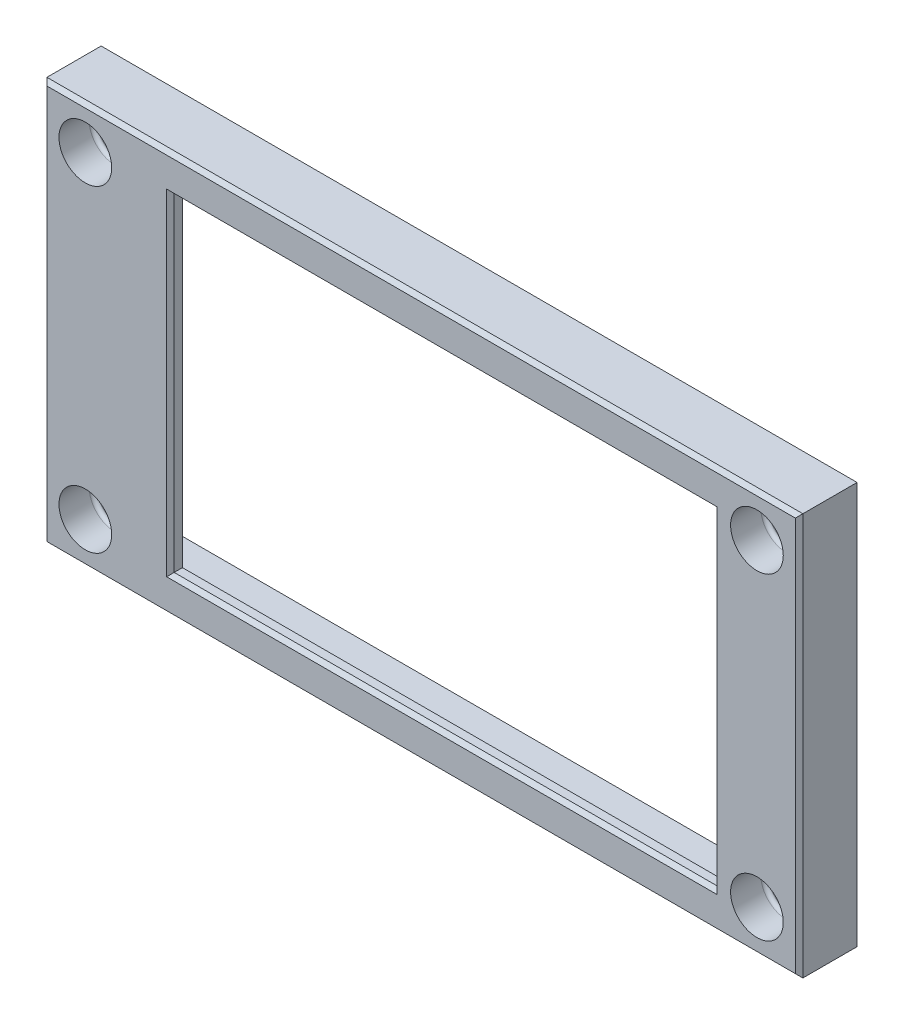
ISO-10303-21;
HEADER;
FILE_DESCRIPTION(('STEP AP214'),'2;1');
FILE_NAME('part.step','',(''),(''),'','','');
FILE_SCHEMA(('AUTOMOTIVE_DESIGN { 1 0 10303 214 1 1 1 1 }'));
ENDSEC;
DATA;
#1=APPLICATION_CONTEXT('core data for automotive mechanical design processes');
#2=APPLICATION_PROTOCOL_DEFINITION('international standard','automotive_design',2000,#1);
#3=PRODUCT_CONTEXT('',#1,'mechanical');
#4=PRODUCT('Part','Part','',(#3));
#5=PRODUCT_RELATED_PRODUCT_CATEGORY('part','',(#4));
#6=PRODUCT_DEFINITION_FORMATION('','',#4);
#7=PRODUCT_DEFINITION_CONTEXT('part definition',#1,'design');
#8=PRODUCT_DEFINITION('design','',#6,#7);
#9=PRODUCT_DEFINITION_SHAPE('','',#8);
#10=(LENGTH_UNIT() NAMED_UNIT(*) SI_UNIT(.MILLI.,.METRE.));
#11=(NAMED_UNIT(*) PLANE_ANGLE_UNIT() SI_UNIT($,.RADIAN.));
#12=(NAMED_UNIT(*) SI_UNIT($,.STERADIAN.) SOLID_ANGLE_UNIT());
#13=UNCERTAINTY_MEASURE_WITH_UNIT(LENGTH_MEASURE(1.E-05),#10,'distance_accuracy_value','');
#14=(GEOMETRIC_REPRESENTATION_CONTEXT(3) GLOBAL_UNCERTAINTY_ASSIGNED_CONTEXT((#13)) GLOBAL_UNIT_ASSIGNED_CONTEXT((#10,
#11,#12)) REPRESENTATION_CONTEXT('',''));
#15=CARTESIAN_POINT('',(0.,0.,0.));
#16=DIRECTION('',(0.,0.,1.));
#17=DIRECTION('',(1.,0.,0.));
#18=AXIS2_PLACEMENT_3D('',#15,#16,#17);
#19=CARTESIAN_POINT('',(0.,0.,7.7));
#20=DIRECTION('',(0.,0.,-1.));
#21=DIRECTION('',(-1.,0.,0.));
#22=AXIS2_PLACEMENT_3D('',#19,#20,#21);
#23=PLANE('',#22);
#24=DIRECTION('',(1.,0.,0.));
#25=VECTOR('',#24,1.);
#26=CARTESIAN_POINT('',(38.8,22.3,7.7));
#27=LINE('',#26,#25);
#28=CARTESIAN_POINT('',(-33.8,22.3,7.7));
#29=VERTEX_POINT('',#28);
#30=CARTESIAN_POINT('',(39.3,22.3,7.7));
#31=VERTEX_POINT('',#30);
#32=EDGE_CURVE('E488',#29,#31,#27,.T.);
#33=ORIENTED_EDGE('',*,*,#32,.T.);
#34=DIRECTION('',(0.,-1.,0.));
#35=VECTOR('',#34,1.);
#36=CARTESIAN_POINT('',(39.3,-21.8,7.7));
#37=LINE('',#36,#35);
#38=CARTESIAN_POINT('',(39.3,-22.3,7.7));
#39=VERTEX_POINT('',#38);
#40=EDGE_CURVE('E490',#31,#39,#37,.T.);
#41=ORIENTED_EDGE('',*,*,#40,.T.);
#42=DIRECTION('',(-1.,0.,0.));
#43=VECTOR('',#42,1.);
#44=CARTESIAN_POINT('',(-33.3,-22.3,7.7));
#45=LINE('',#44,#43);
#46=CARTESIAN_POINT('',(-33.8,-22.3,7.7));
#47=VERTEX_POINT('',#46);
#48=EDGE_CURVE('E486',#39,#47,#45,.T.);
#49=ORIENTED_EDGE('',*,*,#48,.T.);
#50=DIRECTION('',(0.,1.,0.));
#51=VECTOR('',#50,1.);
#52=CARTESIAN_POINT('',(-33.8,21.8,7.7));
#53=LINE('',#52,#51);
#54=EDGE_CURVE('E484',#47,#29,#53,.T.);
#55=ORIENTED_EDGE('',*,*,#54,.T.);
#56=EDGE_LOOP('',(#33,#41,#49,#55));
#57=FACE_BOUND('',#56,.T.);
#58=DIRECTION('',(-1.,0.,0.));
#59=VECTOR('',#58,1.);
#60=CARTESIAN_POINT('',(0.,26.2,7.7));
#61=LINE('',#60,#59);
#62=CARTESIAN_POINT('',(49.7,26.2,7.7));
#63=VERTEX_POINT('',#62);
#64=CARTESIAN_POINT('',(-49.7,26.2,7.7));
#65=VERTEX_POINT('',#64);
#66=EDGE_CURVE('E475',#63,#65,#61,.T.);
#67=ORIENTED_EDGE('',*,*,#66,.T.);
#68=DIRECTION('',(0.,-1.,0.));
#69=VECTOR('',#68,1.);
#70=CARTESIAN_POINT('',(-49.7,0.,7.7));
#71=LINE('',#70,#69);
#72=CARTESIAN_POINT('',(-49.7,-26.2,7.7));
#73=VERTEX_POINT('',#72);
#74=EDGE_CURVE('E481',#65,#73,#71,.T.);
#75=ORIENTED_EDGE('',*,*,#74,.T.);
#76=DIRECTION('',(1.,0.,0.));
#77=VECTOR('',#76,1.);
#78=CARTESIAN_POINT('',(0.,-26.2,7.7));
#79=LINE('',#78,#77);
#80=CARTESIAN_POINT('',(49.7,-26.2,7.7));
#81=VERTEX_POINT('',#80);
#82=EDGE_CURVE('E479',#73,#81,#79,.T.);
#83=ORIENTED_EDGE('',*,*,#82,.T.);
#84=DIRECTION('',(0.,1.,0.));
#85=VECTOR('',#84,1.);
#86=CARTESIAN_POINT('',(49.7,0.,7.7));
#87=LINE('',#86,#85);
#88=EDGE_CURVE('E477',#81,#63,#87,.T.);
#89=ORIENTED_EDGE('',*,*,#88,.T.);
#90=EDGE_LOOP('',(#67,#75,#83,#89));
#91=FACE_BOUND('',#90,.T.);
#92=CARTESIAN_POINT('',(44.6,21.1,7.7));
#93=DIRECTION('',(0.,0.,1.));
#94=DIRECTION('',(1.,0.,0.));
#95=AXIS2_PLACEMENT_3D('',#92,#93,#94);
#96=CIRCLE('',#95,3.5);
#97=CARTESIAN_POINT('',(48.1,21.1,7.7));
#98=VERTEX_POINT('',#97);
#99=EDGE_CURVE('E304',#98,#98,#96,.T.);
#100=ORIENTED_EDGE('',*,*,#99,.F.);
#101=EDGE_LOOP('',(#100));
#102=FACE_BOUND('',#101,.T.);
#103=CARTESIAN_POINT('',(44.6,-21.1,7.7));
#104=DIRECTION('',(0.,0.,-1.));
#105=DIRECTION('',(-1.,0.,0.));
#106=AXIS2_PLACEMENT_3D('',#103,#104,#105);
#107=CIRCLE('',#106,3.5);
#108=CARTESIAN_POINT('',(41.1,-21.1,7.7));
#109=VERTEX_POINT('',#108);
#110=EDGE_CURVE('E301',#109,#109,#107,.T.);
#111=ORIENTED_EDGE('',*,*,#110,.T.);
#112=EDGE_LOOP('',(#111));
#113=FACE_BOUND('',#112,.T.);
#114=CARTESIAN_POINT('',(-44.6,21.1,7.7));
#115=DIRECTION('',(0.,0.,-1.));
#116=DIRECTION('',(-1.,0.,0.));
#117=AXIS2_PLACEMENT_3D('',#114,#115,#116);
#118=CIRCLE('',#117,3.5);
#119=CARTESIAN_POINT('',(-48.1,21.1,7.7));
#120=VERTEX_POINT('',#119);
#121=EDGE_CURVE('E309',#120,#120,#118,.T.);
#122=ORIENTED_EDGE('',*,*,#121,.T.);
#123=EDGE_LOOP('',(#122));
#124=FACE_BOUND('',#123,.T.);
#125=CARTESIAN_POINT('',(-44.6,-21.1,7.7));
#126=DIRECTION('',(0.,0.,1.));
#127=DIRECTION('',(1.,0.,0.));
#128=AXIS2_PLACEMENT_3D('',#125,#126,#127);
#129=CIRCLE('',#128,3.5);
#130=CARTESIAN_POINT('',(-41.1,-21.1,7.7));
#131=VERTEX_POINT('',#130);
#132=EDGE_CURVE('E306',#131,#131,#129,.T.);
#133=ORIENTED_EDGE('',*,*,#132,.F.);
#134=EDGE_LOOP('',(#133));
#135=FACE_BOUND('',#134,.T.);
#136=ADVANCED_FACE('F34',(#57,#91,#102,#113,#124,#135),#23,.F.);
#137=CARTESIAN_POINT('',(44.6,21.1,0.));
#138=DIRECTION('',(0.,0.,1.));
#139=DIRECTION('',(1.,0.,0.));
#140=AXIS2_PLACEMENT_3D('',#137,#138,#139);
#141=CYLINDRICAL_SURFACE('',#140,1.6);
#142=CARTESIAN_POINT('',(44.6,21.1,1.8));
#143=DIRECTION('',(0.,0.,-1.));
#144=DIRECTION('',(-1.,0.,0.));
#145=AXIS2_PLACEMENT_3D('',#142,#143,#144);
#146=CIRCLE('',#145,1.6);
#147=CARTESIAN_POINT('',(43.,21.1,1.8));
#148=VERTEX_POINT('',#147);
#149=EDGE_CURVE('E315',#148,#148,#146,.T.);
#150=ORIENTED_EDGE('',*,*,#149,.T.);
#151=EDGE_LOOP('',(#150));
#152=FACE_BOUND('',#151,.T.);
#153=CARTESIAN_POINT('',(44.6,21.1,3.2));
#154=DIRECTION('',(0.,0.,1.));
#155=DIRECTION('',(1.,0.,0.));
#156=AXIS2_PLACEMENT_3D('',#153,#154,#155);
#157=CIRCLE('',#156,1.6);
#158=CARTESIAN_POINT('',(46.2,21.1,3.2));
#159=VERTEX_POINT('',#158);
#160=EDGE_CURVE('E319',#159,#159,#157,.F.);
#161=ORIENTED_EDGE('',*,*,#160,.F.);
#162=EDGE_LOOP('',(#161));
#163=FACE_BOUND('',#162,.T.);
#164=ADVANCED_FACE('F568',(#152,#163),#141,.F.);
#165=CARTESIAN_POINT('',(-44.6,-21.1,0.));
#166=DIRECTION('',(0.,0.,1.));
#167=DIRECTION('',(1.,0.,0.));
#168=AXIS2_PLACEMENT_3D('',#165,#166,#167);
#169=CYLINDRICAL_SURFACE('',#168,1.6);
#170=CARTESIAN_POINT('',(-44.6,-21.1,1.8));
#171=DIRECTION('',(0.,0.,-1.));
#172=DIRECTION('',(-1.,0.,0.));
#173=AXIS2_PLACEMENT_3D('',#170,#171,#172);
#174=CIRCLE('',#173,1.6);
#175=CARTESIAN_POINT('',(-46.2,-21.1,1.8));
#176=VERTEX_POINT('',#175);
#177=EDGE_CURVE('E318',#176,#176,#174,.T.);
#178=ORIENTED_EDGE('',*,*,#177,.T.);
#179=EDGE_LOOP('',(#178));
#180=FACE_BOUND('',#179,.T.);
#181=CARTESIAN_POINT('',(-44.6,-21.1,3.2));
#182=DIRECTION('',(0.,0.,1.));
#183=DIRECTION('',(1.,0.,0.));
#184=AXIS2_PLACEMENT_3D('',#181,#182,#183);
#185=CIRCLE('',#184,1.6);
#186=CARTESIAN_POINT('',(-43.,-21.1,3.2));
#187=VERTEX_POINT('',#186);
#188=EDGE_CURVE('E434',#187,#187,#185,.F.);
#189=ORIENTED_EDGE('',*,*,#188,.F.);
#190=EDGE_LOOP('',(#189));
#191=FACE_BOUND('',#190,.T.);
#192=ADVANCED_FACE('F610',(#180,#191),#169,.F.);
#193=CARTESIAN_POINT('',(0.,0.,1.8));
#194=DIRECTION('',(0.,0.,-1.));
#195=DIRECTION('',(-1.,0.,0.));
#196=AXIS2_PLACEMENT_3D('',#193,#194,#195);
#197=PLANE('',#196);
#198=DIRECTION('',(0.,1.,0.));
#199=VECTOR('',#198,1.);
#200=CARTESIAN_POINT('',(42.3,15.1,1.8));
#201=LINE('',#200,#199);
#202=CARTESIAN_POINT('',(42.3,-15.1,1.8));
#203=VERTEX_POINT('',#202);
#204=CARTESIAN_POINT('',(42.3,15.1,1.8));
#205=VERTEX_POINT('',#204);
#206=EDGE_CURVE('E51',#203,#205,#201,.T.);
#207=ORIENTED_EDGE('',*,*,#206,.F.);
#208=DIRECTION('',(-1.,0.,0.));
#209=VECTOR('',#208,1.);
#210=CARTESIAN_POINT('',(47.,-15.1,1.8));
#211=LINE('',#210,#209);
#212=CARTESIAN_POINT('',(47.,-15.1,1.8));
#213=VERTEX_POINT('',#212);
#214=EDGE_CURVE('E252',#213,#203,#211,.T.);
#215=ORIENTED_EDGE('',*,*,#214,.F.);
#216=DIRECTION('',(0.,-1.,0.));
#217=VECTOR('',#216,1.);
#218=CARTESIAN_POINT('',(47.,15.1,1.8));
#219=LINE('',#218,#217);
#220=CARTESIAN_POINT('',(47.,15.1,1.8));
#221=VERTEX_POINT('',#220);
#222=EDGE_CURVE('E255',#221,#213,#219,.T.);
#223=ORIENTED_EDGE('',*,*,#222,.F.);
#224=DIRECTION('',(1.,0.,0.));
#225=VECTOR('',#224,1.);
#226=CARTESIAN_POINT('',(47.,15.1,1.8));
#227=LINE('',#226,#225);
#228=EDGE_CURVE('E261',#205,#221,#227,.T.);
#229=ORIENTED_EDGE('',*,*,#228,.F.);
#230=EDGE_LOOP('',(#207,#215,#223,#229));
#231=FACE_BOUND('',#230,.T.);
#232=DIRECTION('',(1.,0.,0.));
#233=VECTOR('',#232,1.);
#234=CARTESIAN_POINT('',(-47.8,-24.3,1.8));
#235=LINE('',#234,#233);
#236=CARTESIAN_POINT('',(41.5,-24.3,1.8));
#237=VERTEX_POINT('',#236);
#238=CARTESIAN_POINT('',(47.8,-24.3,1.8));
#239=VERTEX_POINT('',#238);
#240=EDGE_CURVE('E384',#237,#239,#235,.T.);
#241=ORIENTED_EDGE('',*,*,#240,.F.);
#242=DIRECTION('',(0.,1.,0.));
#243=VECTOR('',#242,1.);
#244=CARTESIAN_POINT('',(41.5,0.,1.8));
#245=LINE('',#244,#243);
#246=CARTESIAN_POINT('',(41.5,24.3,1.8));
#247=VERTEX_POINT('',#246);
#248=EDGE_CURVE('E462',#237,#247,#245,.T.);
#249=ORIENTED_EDGE('',*,*,#248,.T.);
#250=DIRECTION('',(-1.,0.,0.));
#251=VECTOR('',#250,1.);
#252=CARTESIAN_POINT('',(47.8,24.3,1.8));
#253=LINE('',#252,#251);
#254=CARTESIAN_POINT('',(47.8,24.3,1.8));
#255=VERTEX_POINT('',#254);
#256=EDGE_CURVE('E378',#255,#247,#253,.T.);
#257=ORIENTED_EDGE('',*,*,#256,.F.);
#258=DIRECTION('',(0.,1.,0.));
#259=VECTOR('',#258,1.);
#260=CARTESIAN_POINT('',(47.8,-24.3,1.8));
#261=LINE('',#260,#259);
#262=EDGE_CURVE('E373',#239,#255,#261,.T.);
#263=ORIENTED_EDGE('',*,*,#262,.F.);
#264=EDGE_LOOP('',(#241,#249,#257,#263));
#265=FACE_BOUND('',#264,.T.);
#266=ORIENTED_EDGE('',*,*,#149,.F.);
#267=EDGE_LOOP('',(#266));
#268=FACE_BOUND('',#267,.T.);
#269=CARTESIAN_POINT('',(44.6,-21.1,1.8));
#270=DIRECTION('',(0.,0.,-1.));
#271=DIRECTION('',(-1.,0.,0.));
#272=AXIS2_PLACEMENT_3D('',#269,#270,#271);
#273=CIRCLE('',#272,1.6);
#274=CARTESIAN_POINT('',(43.,-21.1,1.8));
#275=VERTEX_POINT('',#274);
#276=EDGE_CURVE('E325',#275,#275,#273,.F.);
#277=ORIENTED_EDGE('',*,*,#276,.T.);
#278=EDGE_LOOP('',(#277));
#279=FACE_BOUND('',#278,.T.);
#280=ADVANCED_FACE('F613',(#231,#265,#268,#279),#197,.T.);
#281=DIRECTION('',(0.,1.,0.));
#282=VECTOR('',#281,1.);
#283=CARTESIAN_POINT('',(-47.,15.1,1.8));
#284=LINE('',#283,#282);
#285=CARTESIAN_POINT('',(-47.,-15.1,1.8));
#286=VERTEX_POINT('',#285);
#287=CARTESIAN_POINT('',(-47.,15.1,1.8));
#288=VERTEX_POINT('',#287);
#289=EDGE_CURVE('E59',#286,#288,#284,.T.);
#290=ORIENTED_EDGE('',*,*,#289,.F.);
#291=DIRECTION('',(-1.,0.,0.));
#292=VECTOR('',#291,1.);
#293=CARTESIAN_POINT('',(-47.,-15.1,1.8));
#294=LINE('',#293,#292);
#295=CARTESIAN_POINT('',(-42.3,-15.1,1.8));
#296=VERTEX_POINT('',#295);
#297=EDGE_CURVE('E276',#296,#286,#294,.T.);
#298=ORIENTED_EDGE('',*,*,#297,.F.);
#299=DIRECTION('',(0.,-1.,0.));
#300=VECTOR('',#299,1.);
#301=CARTESIAN_POINT('',(-42.3,15.1,1.8));
#302=LINE('',#301,#300);
#303=CARTESIAN_POINT('',(-42.3,15.1,1.8));
#304=VERTEX_POINT('',#303);
#305=EDGE_CURVE('E290',#304,#296,#302,.T.);
#306=ORIENTED_EDGE('',*,*,#305,.F.);
#307=DIRECTION('',(1.,0.,0.));
#308=VECTOR('',#307,1.);
#309=CARTESIAN_POINT('',(-47.,15.1,1.8));
#310=LINE('',#309,#308);
#311=EDGE_CURVE('E287',#288,#304,#310,.T.);
#312=ORIENTED_EDGE('',*,*,#311,.F.);
#313=EDGE_LOOP('',(#290,#298,#306,#312));
#314=FACE_BOUND('',#313,.T.);
#315=CARTESIAN_POINT('',(-41.5,24.3,1.8));
#316=VERTEX_POINT('',#315);
#317=CARTESIAN_POINT('',(-47.8,24.3,1.8));
#318=VERTEX_POINT('',#317);
#319=EDGE_CURVE('E376',#316,#318,#253,.T.);
#320=ORIENTED_EDGE('',*,*,#319,.F.);
#321=DIRECTION('',(0.,-1.,0.));
#322=VECTOR('',#321,1.);
#323=CARTESIAN_POINT('',(-41.5,0.,1.8));
#324=LINE('',#323,#322);
#325=CARTESIAN_POINT('',(-41.5,-24.3,1.8));
#326=VERTEX_POINT('',#325);
#327=EDGE_CURVE('E467',#316,#326,#324,.T.);
#328=ORIENTED_EDGE('',*,*,#327,.T.);
#329=CARTESIAN_POINT('',(-47.8,-24.3,1.8));
#330=VERTEX_POINT('',#329);
#331=EDGE_CURVE('E385',#330,#326,#235,.T.);
#332=ORIENTED_EDGE('',*,*,#331,.F.);
#333=DIRECTION('',(0.,-1.,0.));
#334=VECTOR('',#333,1.);
#335=CARTESIAN_POINT('',(-47.8,24.3,1.8));
#336=LINE('',#335,#334);
#337=EDGE_CURVE('E381',#318,#330,#336,.T.);
#338=ORIENTED_EDGE('',*,*,#337,.F.);
#339=EDGE_LOOP('',(#320,#328,#332,#338));
#340=FACE_BOUND('',#339,.T.);
#341=ORIENTED_EDGE('',*,*,#177,.F.);
#342=EDGE_LOOP('',(#341));
#343=FACE_BOUND('',#342,.T.);
#344=CARTESIAN_POINT('',(-44.6,21.1,1.8));
#345=DIRECTION('',(0.,0.,-1.));
#346=DIRECTION('',(-1.,0.,0.));
#347=AXIS2_PLACEMENT_3D('',#344,#345,#346);
#348=CIRCLE('',#347,1.6);
#349=CARTESIAN_POINT('',(-46.2,21.1,1.8));
#350=VERTEX_POINT('',#349);
#351=EDGE_CURVE('E322',#350,#350,#348,.F.);
#352=ORIENTED_EDGE('',*,*,#351,.T.);
#353=EDGE_LOOP('',(#352));
#354=FACE_BOUND('',#353,.T.);
#355=ADVANCED_FACE('F658',(#314,#340,#343,#354),#197,.T.);
#356=CARTESIAN_POINT('',(0.,0.,0.));
#357=DIRECTION('',(0.,0.,1.));
#358=DIRECTION('',(1.,0.,0.));
#359=AXIS2_PLACEMENT_3D('',#356,#357,#358);
#360=PLANE('',#359);
#361=DIRECTION('',(0.,1.,0.));
#362=VECTOR('',#361,1.);
#363=CARTESIAN_POINT('',(50.2,-26.7,0.));
#364=LINE('',#363,#362);
#365=CARTESIAN_POINT('',(50.2,-26.7,0.));
#366=VERTEX_POINT('',#365);
#367=CARTESIAN_POINT('',(50.2,26.7,0.));
#368=VERTEX_POINT('',#367);
#369=EDGE_CURVE('E408',#366,#368,#364,.T.);
#370=ORIENTED_EDGE('',*,*,#369,.F.);
#371=DIRECTION('',(1.,0.,0.));
#372=VECTOR('',#371,1.);
#373=CARTESIAN_POINT('',(-50.2,-26.7,0.));
#374=LINE('',#373,#372);
#375=CARTESIAN_POINT('',(-50.2,-26.7,0.));
#376=VERTEX_POINT('',#375);
#377=EDGE_CURVE('E417',#376,#366,#374,.T.);
#378=ORIENTED_EDGE('',*,*,#377,.F.);
#379=DIRECTION('',(0.,-1.,0.));
#380=VECTOR('',#379,1.);
#381=CARTESIAN_POINT('',(-50.2,26.7,0.));
#382=LINE('',#381,#380);
#383=CARTESIAN_POINT('',(-50.2,26.7,0.));
#384=VERTEX_POINT('',#383);
#385=EDGE_CURVE('E414',#384,#376,#382,.T.);
#386=ORIENTED_EDGE('',*,*,#385,.F.);
#387=DIRECTION('',(-1.,0.,0.));
#388=VECTOR('',#387,1.);
#389=CARTESIAN_POINT('',(50.2,26.7,0.));
#390=LINE('',#389,#388);
#391=EDGE_CURVE('E411',#368,#384,#390,.T.);
#392=ORIENTED_EDGE('',*,*,#391,.F.);
#393=EDGE_LOOP('',(#370,#378,#386,#392));
#394=FACE_BOUND('',#393,.T.);
#395=DIRECTION('',(0.,1.,0.));
#396=VECTOR('',#395,1.);
#397=CARTESIAN_POINT('',(47.8,-24.3,0.));
#398=LINE('',#397,#396);
#399=CARTESIAN_POINT('',(47.8,-24.3,0.));
#400=VERTEX_POINT('',#399);
#401=CARTESIAN_POINT('',(47.8,24.3,0.));
#402=VERTEX_POINT('',#401);
#403=EDGE_CURVE('E372',#400,#402,#398,.T.);
#404=ORIENTED_EDGE('',*,*,#403,.T.);
#405=DIRECTION('',(-1.,0.,0.));
#406=VECTOR('',#405,1.);
#407=CARTESIAN_POINT('',(47.8,24.3,0.));
#408=LINE('',#407,#406);
#409=CARTESIAN_POINT('',(-47.8,24.3,0.));
#410=VERTEX_POINT('',#409);
#411=EDGE_CURVE('E391',#402,#410,#408,.T.);
#412=ORIENTED_EDGE('',*,*,#411,.T.);
#413=DIRECTION('',(0.,-1.,0.));
#414=VECTOR('',#413,1.);
#415=CARTESIAN_POINT('',(-47.8,24.3,0.));
#416=LINE('',#415,#414);
#417=CARTESIAN_POINT('',(-47.8,-24.3,0.));
#418=VERTEX_POINT('',#417);
#419=EDGE_CURVE('E394',#410,#418,#416,.T.);
#420=ORIENTED_EDGE('',*,*,#419,.T.);
#421=DIRECTION('',(1.,0.,0.));
#422=VECTOR('',#421,1.);
#423=CARTESIAN_POINT('',(-47.8,-24.3,0.));
#424=LINE('',#423,#422);
#425=EDGE_CURVE('E377',#418,#400,#424,.T.);
#426=ORIENTED_EDGE('',*,*,#425,.T.);
#427=EDGE_LOOP('',(#404,#412,#420,#426));
#428=FACE_BOUND('',#427,.T.);
#429=ADVANCED_FACE('F552',(#394,#428),#360,.F.);
#430=CARTESIAN_POINT('',(50.2,-26.7,1.8));
#431=DIRECTION('',(-1.,0.,0.));
#432=DIRECTION('',(0.,0.,1.));
#433=AXIS2_PLACEMENT_3D('',#430,#431,#432);
#434=PLANE('',#433);
#435=DIRECTION('',(0.,0.,-1.));
#436=VECTOR('',#435,1.);
#437=CARTESIAN_POINT('',(50.2,26.7,1.8));
#438=LINE('',#437,#436);
#439=CARTESIAN_POINT('',(50.2,26.7,7.2));
#440=VERTEX_POINT('',#439);
#441=EDGE_CURVE('E426',#440,#368,#438,.T.);
#442=ORIENTED_EDGE('',*,*,#441,.F.);
#443=DIRECTION('',(0.,-1.,0.));
#444=VECTOR('',#443,1.);
#445=CARTESIAN_POINT('',(50.2,-26.7,7.2));
#446=LINE('',#445,#444);
#447=CARTESIAN_POINT('',(50.2,-26.7,7.2));
#448=VERTEX_POINT('',#447);
#449=EDGE_CURVE('E504',#440,#448,#446,.T.);
#450=ORIENTED_EDGE('',*,*,#449,.T.);
#451=DIRECTION('',(0.,0.,-1.));
#452=VECTOR('',#451,1.);
#453=CARTESIAN_POINT('',(50.2,-26.7,1.8));
#454=LINE('',#453,#452);
#455=EDGE_CURVE('E420',#448,#366,#454,.T.);
#456=ORIENTED_EDGE('',*,*,#455,.T.);
#457=ORIENTED_EDGE('',*,*,#369,.T.);
#458=EDGE_LOOP('',(#442,#450,#456,#457));
#459=FACE_BOUND('',#458,.T.);
#460=ADVANCED_FACE('F543',(#459),#434,.F.);
#461=CARTESIAN_POINT('',(50.2,26.7,1.8));
#462=DIRECTION('',(0.,-1.,0.));
#463=DIRECTION('',(0.,0.,-1.));
#464=AXIS2_PLACEMENT_3D('',#461,#462,#463);
#465=PLANE('',#464);
#466=DIRECTION('',(0.,0.,-1.));
#467=VECTOR('',#466,1.);
#468=CARTESIAN_POINT('',(-50.2,26.7,1.8));
#469=LINE('',#468,#467);
#470=CARTESIAN_POINT('',(-50.2,26.7,7.2));
#471=VERTEX_POINT('',#470);
#472=EDGE_CURVE('E424',#471,#384,#469,.T.);
#473=ORIENTED_EDGE('',*,*,#472,.F.);
#474=DIRECTION('',(1.,0.,0.));
#475=VECTOR('',#474,1.);
#476=CARTESIAN_POINT('',(50.2,26.7,7.2));
#477=LINE('',#476,#475);
#478=EDGE_CURVE('E506',#471,#440,#477,.T.);
#479=ORIENTED_EDGE('',*,*,#478,.T.);
#480=ORIENTED_EDGE('',*,*,#441,.T.);
#481=ORIENTED_EDGE('',*,*,#391,.T.);
#482=EDGE_LOOP('',(#473,#479,#480,#481));
#483=FACE_BOUND('',#482,.T.);
#484=ADVANCED_FACE('F556',(#483),#465,.F.);
#485=CARTESIAN_POINT('',(-50.2,26.7,1.8));
#486=DIRECTION('',(1.,0.,0.));
#487=DIRECTION('',(0.,0.,-1.));
#488=AXIS2_PLACEMENT_3D('',#485,#486,#487);
#489=PLANE('',#488);
#490=DIRECTION('',(0.,0.,-1.));
#491=VECTOR('',#490,1.);
#492=CARTESIAN_POINT('',(-50.2,-26.7,1.8));
#493=LINE('',#492,#491);
#494=CARTESIAN_POINT('',(-50.2,-26.7,7.2));
#495=VERTEX_POINT('',#494);
#496=EDGE_CURVE('E422',#495,#376,#493,.T.);
#497=ORIENTED_EDGE('',*,*,#496,.F.);
#498=DIRECTION('',(0.,1.,0.));
#499=VECTOR('',#498,1.);
#500=CARTESIAN_POINT('',(-50.2,26.7,7.2));
#501=LINE('',#500,#499);
#502=EDGE_CURVE('E499',#495,#471,#501,.T.);
#503=ORIENTED_EDGE('',*,*,#502,.T.);
#504=ORIENTED_EDGE('',*,*,#472,.T.);
#505=ORIENTED_EDGE('',*,*,#385,.T.);
#506=EDGE_LOOP('',(#497,#503,#504,#505));
#507=FACE_BOUND('',#506,.T.);
#508=ADVANCED_FACE('F558',(#507),#489,.F.);
#509=CARTESIAN_POINT('',(-50.2,-26.7,1.8));
#510=DIRECTION('',(0.,1.,0.));
#511=DIRECTION('',(0.,0.,1.));
#512=AXIS2_PLACEMENT_3D('',#509,#510,#511);
#513=PLANE('',#512);
#514=ORIENTED_EDGE('',*,*,#455,.F.);
#515=DIRECTION('',(-1.,0.,0.));
#516=VECTOR('',#515,1.);
#517=CARTESIAN_POINT('',(-50.2,-26.7,7.2));
#518=LINE('',#517,#516);
#519=EDGE_CURVE('E502',#448,#495,#518,.T.);
#520=ORIENTED_EDGE('',*,*,#519,.T.);
#521=ORIENTED_EDGE('',*,*,#496,.T.);
#522=ORIENTED_EDGE('',*,*,#377,.T.);
#523=EDGE_LOOP('',(#514,#520,#521,#522));
#524=FACE_BOUND('',#523,.T.);
#525=ADVANCED_FACE('F545',(#524),#513,.F.);
#526=CARTESIAN_POINT('',(47.8,-24.3,1.8));
#527=DIRECTION('',(-1.,0.,0.));
#528=DIRECTION('',(0.,-1.,0.));
#529=AXIS2_PLACEMENT_3D('',#526,#527,#528);
#530=PLANE('',#529);
#531=ORIENTED_EDGE('',*,*,#403,.F.);
#532=DIRECTION('',(0.,0.,-1.));
#533=VECTOR('',#532,1.);
#534=CARTESIAN_POINT('',(47.8,-24.3,1.8));
#535=LINE('',#534,#533);
#536=EDGE_CURVE('E388',#239,#400,#535,.T.);
#537=ORIENTED_EDGE('',*,*,#536,.F.);
#538=ORIENTED_EDGE('',*,*,#262,.T.);
#539=DIRECTION('',(0.,0.,-1.));
#540=VECTOR('',#539,1.);
#541=CARTESIAN_POINT('',(47.8,24.3,1.8));
#542=LINE('',#541,#540);
#543=EDGE_CURVE('E405',#255,#402,#542,.T.);
#544=ORIENTED_EDGE('',*,*,#543,.T.);
#545=EDGE_LOOP('',(#531,#537,#538,#544));
#546=FACE_BOUND('',#545,.T.);
#547=ADVANCED_FACE('F670',(#546),#530,.T.);
#548=CARTESIAN_POINT('',(47.8,24.3,1.8));
#549=DIRECTION('',(0.,-1.,0.));
#550=DIRECTION('',(0.,0.,-1.));
#551=AXIS2_PLACEMENT_3D('',#548,#549,#550);
#552=PLANE('',#551);
#553=ORIENTED_EDGE('',*,*,#411,.F.);
#554=ORIENTED_EDGE('',*,*,#543,.F.);
#555=ORIENTED_EDGE('',*,*,#256,.T.);
#556=DIRECTION('',(0.707106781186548,0.,-0.707106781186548));
#557=VECTOR('',#556,1.);
#558=CARTESIAN_POINT('',(41.5,24.3,1.8));
#559=LINE('',#558,#557);
#560=CARTESIAN_POINT('',(41.,24.3,2.3));
#561=VERTEX_POINT('',#560);
#562=EDGE_CURVE('E508',#247,#561,#559,.F.);
#563=ORIENTED_EDGE('',*,*,#562,.T.);
#564=DIRECTION('',(0.,0.,-1.));
#565=VECTOR('',#564,1.);
#566=CARTESIAN_POINT('',(41.,24.3,6.1));
#567=LINE('',#566,#565);
#568=CARTESIAN_POINT('',(41.,24.3,6.1));
#569=VERTEX_POINT('',#568);
#570=EDGE_CURVE('E369',#569,#561,#567,.T.);
#571=ORIENTED_EDGE('',*,*,#570,.F.);
#572=DIRECTION('',(-1.,0.,0.));
#573=VECTOR('',#572,1.);
#574=CARTESIAN_POINT('',(-41.,24.3,6.1));
#575=LINE('',#574,#573);
#576=CARTESIAN_POINT('',(-41.,24.3,6.1));
#577=VERTEX_POINT('',#576);
#578=EDGE_CURVE('E351',#569,#577,#575,.T.);
#579=ORIENTED_EDGE('',*,*,#578,.T.);
#580=DIRECTION('',(0.,0.,-1.));
#581=VECTOR('',#580,1.);
#582=CARTESIAN_POINT('',(-41.,24.3,6.1));
#583=LINE('',#582,#581);
#584=CARTESIAN_POINT('',(-41.,24.3,2.3));
#585=VERTEX_POINT('',#584);
#586=EDGE_CURVE('E366',#577,#585,#583,.T.);
#587=ORIENTED_EDGE('',*,*,#586,.T.);
#588=DIRECTION('',(0.707106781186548,0.,0.707106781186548));
#589=VECTOR('',#588,1.);
#590=CARTESIAN_POINT('',(-41.5,24.3,1.8));
#591=LINE('',#590,#589);
#592=EDGE_CURVE('E11',#585,#316,#591,.F.);
#593=ORIENTED_EDGE('',*,*,#592,.T.);
#594=ORIENTED_EDGE('',*,*,#319,.T.);
#595=DIRECTION('',(0.,0.,-1.));
#596=VECTOR('',#595,1.);
#597=CARTESIAN_POINT('',(-47.8,24.3,1.8));
#598=LINE('',#597,#596);
#599=EDGE_CURVE('E403',#318,#410,#598,.T.);
#600=ORIENTED_EDGE('',*,*,#599,.T.);
#601=EDGE_LOOP('',(#553,#554,#555,#563,#571,#579,#587,#593,#594,#600));
#602=FACE_BOUND('',#601,.T.);
#603=ADVANCED_FACE('F666',(#602),#552,.T.);
#604=CARTESIAN_POINT('',(-47.8,24.3,1.8));
#605=DIRECTION('',(1.,0.,0.));
#606=DIRECTION('',(0.,0.,-1.));
#607=AXIS2_PLACEMENT_3D('',#604,#605,#606);
#608=PLANE('',#607);
#609=ORIENTED_EDGE('',*,*,#419,.F.);
#610=ORIENTED_EDGE('',*,*,#599,.F.);
#611=ORIENTED_EDGE('',*,*,#337,.T.);
#612=DIRECTION('',(0.,0.,-1.));
#613=VECTOR('',#612,1.);
#614=CARTESIAN_POINT('',(-47.8,-24.3,1.8));
#615=LINE('',#614,#613);
#616=EDGE_CURVE('E401',#330,#418,#615,.T.);
#617=ORIENTED_EDGE('',*,*,#616,.T.);
#618=EDGE_LOOP('',(#609,#610,#611,#617));
#619=FACE_BOUND('',#618,.T.);
#620=ADVANCED_FACE('F662',(#619),#608,.T.);
#621=CARTESIAN_POINT('',(-47.8,-24.3,1.8));
#622=DIRECTION('',(0.,1.,0.));
#623=DIRECTION('',(-1.,0.,0.));
#624=AXIS2_PLACEMENT_3D('',#621,#622,#623);
#625=PLANE('',#624);
#626=ORIENTED_EDGE('',*,*,#425,.F.);
#627=ORIENTED_EDGE('',*,*,#616,.F.);
#628=ORIENTED_EDGE('',*,*,#331,.T.);
#629=DIRECTION('',(-0.707106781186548,0.,-0.707106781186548));
#630=VECTOR('',#629,1.);
#631=CARTESIAN_POINT('',(-41.5,-24.3,1.8));
#632=LINE('',#631,#630);
#633=CARTESIAN_POINT('',(-41.,-24.3,2.3));
#634=VERTEX_POINT('',#633);
#635=EDGE_CURVE('E43',#326,#634,#632,.F.);
#636=ORIENTED_EDGE('',*,*,#635,.T.);
#637=DIRECTION('',(0.,0.,-1.));
#638=VECTOR('',#637,1.);
#639=CARTESIAN_POINT('',(-41.,-24.3,6.1));
#640=LINE('',#639,#638);
#641=CARTESIAN_POINT('',(-41.,-24.3,6.1));
#642=VERTEX_POINT('',#641);
#643=EDGE_CURVE('E363',#642,#634,#640,.T.);
#644=ORIENTED_EDGE('',*,*,#643,.F.);
#645=DIRECTION('',(1.,0.,0.));
#646=VECTOR('',#645,1.);
#647=CARTESIAN_POINT('',(-41.,-24.3,6.1));
#648=LINE('',#647,#646);
#649=CARTESIAN_POINT('',(41.,-24.3,6.1));
#650=VERTEX_POINT('',#649);
#651=EDGE_CURVE('E357',#642,#650,#648,.T.);
#652=ORIENTED_EDGE('',*,*,#651,.T.);
#653=DIRECTION('',(0.,0.,-1.));
#654=VECTOR('',#653,1.);
#655=CARTESIAN_POINT('',(41.,-24.3,6.1));
#656=LINE('',#655,#654);
#657=CARTESIAN_POINT('',(41.,-24.3,2.3));
#658=VERTEX_POINT('',#657);
#659=EDGE_CURVE('E360',#650,#658,#656,.T.);
#660=ORIENTED_EDGE('',*,*,#659,.T.);
#661=DIRECTION('',(-0.707106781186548,0.,0.707106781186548));
#662=VECTOR('',#661,1.);
#663=CARTESIAN_POINT('',(41.5,-24.3,1.8));
#664=LINE('',#663,#662);
#665=EDGE_CURVE('E510',#658,#237,#664,.F.);
#666=ORIENTED_EDGE('',*,*,#665,.T.);
#667=ORIENTED_EDGE('',*,*,#240,.T.);
#668=ORIENTED_EDGE('',*,*,#536,.T.);
#669=EDGE_LOOP('',(#626,#627,#628,#636,#644,#652,#660,#666,#667,#668));
#670=FACE_BOUND('',#669,.T.);
#671=ADVANCED_FACE('F654',(#670),#625,.T.);
#672=CARTESIAN_POINT('',(41.,-24.3,6.1));
#673=DIRECTION('',(-1.,0.,0.));
#674=DIRECTION('',(0.,0.,1.));
#675=AXIS2_PLACEMENT_3D('',#672,#673,#674);
#676=PLANE('',#675);
#677=ORIENTED_EDGE('',*,*,#570,.T.);
#678=DIRECTION('',(0.,-1.,0.));
#679=VECTOR('',#678,1.);
#680=CARTESIAN_POINT('',(41.,-24.3,2.3));
#681=LINE('',#680,#679);
#682=EDGE_CURVE('E465',#561,#658,#681,.T.);
#683=ORIENTED_EDGE('',*,*,#682,.T.);
#684=ORIENTED_EDGE('',*,*,#659,.F.);
#685=DIRECTION('',(0.,1.,0.));
#686=VECTOR('',#685,1.);
#687=CARTESIAN_POINT('',(41.,-24.3,6.1));
#688=LINE('',#687,#686);
#689=EDGE_CURVE('E348',#650,#569,#688,.T.);
#690=ORIENTED_EDGE('',*,*,#689,.T.);
#691=EDGE_LOOP('',(#677,#683,#684,#690));
#692=FACE_BOUND('',#691,.T.);
#693=ADVANCED_FACE('F650',(#692),#676,.T.);
#694=CARTESIAN_POINT('',(-41.,-24.3,6.1));
#695=DIRECTION('',(1.,0.,0.));
#696=DIRECTION('',(0.,0.,-1.));
#697=AXIS2_PLACEMENT_3D('',#694,#695,#696);
#698=PLANE('',#697);
#699=ORIENTED_EDGE('',*,*,#643,.T.);
#700=DIRECTION('',(0.,1.,0.));
#701=VECTOR('',#700,1.);
#702=CARTESIAN_POINT('',(-41.,-24.3,2.3));
#703=LINE('',#702,#701);
#704=EDGE_CURVE('E470',#634,#585,#703,.T.);
#705=ORIENTED_EDGE('',*,*,#704,.T.);
#706=ORIENTED_EDGE('',*,*,#586,.F.);
#707=DIRECTION('',(0.,-1.,0.));
#708=VECTOR('',#707,1.);
#709=CARTESIAN_POINT('',(-41.,-24.3,6.1));
#710=LINE('',#709,#708);
#711=EDGE_CURVE('E354',#577,#642,#710,.T.);
#712=ORIENTED_EDGE('',*,*,#711,.T.);
#713=EDGE_LOOP('',(#699,#705,#706,#712));
#714=FACE_BOUND('',#713,.T.);
#715=ADVANCED_FACE('F646',(#714),#698,.T.);
#716=CARTESIAN_POINT('',(0.,0.,6.1));
#717=DIRECTION('',(0.,0.,-1.));
#718=DIRECTION('',(-1.,0.,0.));
#719=AXIS2_PLACEMENT_3D('',#716,#717,#718);
#720=PLANE('',#719);
#721=DIRECTION('',(-1.,0.,0.));
#722=VECTOR('',#721,1.);
#723=CARTESIAN_POINT('',(-33.3,21.8,6.1));
#724=LINE('',#723,#722);
#725=CARTESIAN_POINT('',(38.8,21.8,6.1));
#726=VERTEX_POINT('',#725);
#727=CARTESIAN_POINT('',(-33.3,21.8,6.1));
#728=VERTEX_POINT('',#727);
#729=EDGE_CURVE('E337',#726,#728,#724,.T.);
#730=ORIENTED_EDGE('',*,*,#729,.T.);
#731=DIRECTION('',(0.,-1.,0.));
#732=VECTOR('',#731,1.);
#733=CARTESIAN_POINT('',(-33.3,21.8,6.1));
#734=LINE('',#733,#732);
#735=CARTESIAN_POINT('',(-33.3,-21.8,6.1));
#736=VERTEX_POINT('',#735);
#737=EDGE_CURVE('E328',#728,#736,#734,.T.);
#738=ORIENTED_EDGE('',*,*,#737,.T.);
#739=DIRECTION('',(1.,0.,0.));
#740=VECTOR('',#739,1.);
#741=CARTESIAN_POINT('',(-33.3,-21.8,6.1));
#742=LINE('',#741,#740);
#743=CARTESIAN_POINT('',(38.8,-21.8,6.1));
#744=VERTEX_POINT('',#743);
#745=EDGE_CURVE('E331',#736,#744,#742,.T.);
#746=ORIENTED_EDGE('',*,*,#745,.T.);
#747=DIRECTION('',(0.,1.,0.));
#748=VECTOR('',#747,1.);
#749=CARTESIAN_POINT('',(38.8,21.8,6.1));
#750=LINE('',#749,#748);
#751=EDGE_CURVE('E334',#744,#726,#750,.T.);
#752=ORIENTED_EDGE('',*,*,#751,.T.);
#753=EDGE_LOOP('',(#730,#738,#746,#752));
#754=FACE_BOUND('',#753,.T.);
#755=ORIENTED_EDGE('',*,*,#689,.F.);
#756=ORIENTED_EDGE('',*,*,#651,.F.);
#757=ORIENTED_EDGE('',*,*,#711,.F.);
#758=ORIENTED_EDGE('',*,*,#578,.F.);
#759=EDGE_LOOP('',(#755,#756,#757,#758));
#760=FACE_BOUND('',#759,.T.);
#761=ADVANCED_FACE('F641',(#754,#760),#720,.T.);
#762=CARTESIAN_POINT('',(-33.3,21.8,7.7));
#763=DIRECTION('',(1.,0.,0.));
#764=DIRECTION('',(0.,0.,-1.));
#765=AXIS2_PLACEMENT_3D('',#762,#763,#764);
#766=PLANE('',#765);
#767=DIRECTION('',(0.,0.,-1.));
#768=VECTOR('',#767,1.);
#769=CARTESIAN_POINT('',(-33.3,21.8,7.7));
#770=LINE('',#769,#768);
#771=CARTESIAN_POINT('',(-33.3,21.8,7.2));
#772=VERTEX_POINT('',#771);
#773=EDGE_CURVE('E340',#772,#728,#770,.T.);
#774=ORIENTED_EDGE('',*,*,#773,.F.);
#775=DIRECTION('',(0.,-1.,0.));
#776=VECTOR('',#775,1.);
#777=CARTESIAN_POINT('',(-33.3,-21.8,7.2));
#778=LINE('',#777,#776);
#779=CARTESIAN_POINT('',(-33.3,-21.8,7.2));
#780=VERTEX_POINT('',#779);
#781=EDGE_CURVE('E497',#772,#780,#778,.T.);
#782=ORIENTED_EDGE('',*,*,#781,.T.);
#783=DIRECTION('',(0.,0.,-1.));
#784=VECTOR('',#783,1.);
#785=CARTESIAN_POINT('',(-33.3,-21.8,7.7));
#786=LINE('',#785,#784);
#787=EDGE_CURVE('E346',#780,#736,#786,.T.);
#788=ORIENTED_EDGE('',*,*,#787,.T.);
#789=ORIENTED_EDGE('',*,*,#737,.F.);
#790=EDGE_LOOP('',(#774,#782,#788,#789));
#791=FACE_BOUND('',#790,.T.);
#792=ADVANCED_FACE('F638',(#791),#766,.T.);
#793=CARTESIAN_POINT('',(-33.3,-21.8,7.7));
#794=DIRECTION('',(0.,1.,0.));
#795=DIRECTION('',(0.,0.,1.));
#796=AXIS2_PLACEMENT_3D('',#793,#794,#795);
#797=PLANE('',#796);
#798=ORIENTED_EDGE('',*,*,#787,.F.);
#799=DIRECTION('',(1.,0.,0.));
#800=VECTOR('',#799,1.);
#801=CARTESIAN_POINT('',(38.8,-21.8,7.2));
#802=LINE('',#801,#800);
#803=CARTESIAN_POINT('',(38.8,-21.8,7.2));
#804=VERTEX_POINT('',#803);
#805=EDGE_CURVE('E495',#780,#804,#802,.T.);
#806=ORIENTED_EDGE('',*,*,#805,.T.);
#807=DIRECTION('',(0.,0.,-1.));
#808=VECTOR('',#807,1.);
#809=CARTESIAN_POINT('',(38.8,-21.8,7.7));
#810=LINE('',#809,#808);
#811=EDGE_CURVE('E344',#804,#744,#810,.T.);
#812=ORIENTED_EDGE('',*,*,#811,.T.);
#813=ORIENTED_EDGE('',*,*,#745,.F.);
#814=EDGE_LOOP('',(#798,#806,#812,#813));
#815=FACE_BOUND('',#814,.T.);
#816=ADVANCED_FACE('F634',(#815),#797,.T.);
#817=CARTESIAN_POINT('',(38.8,21.8,7.7));
#818=DIRECTION('',(-1.,0.,0.));
#819=DIRECTION('',(0.,0.,1.));
#820=AXIS2_PLACEMENT_3D('',#817,#818,#819);
#821=PLANE('',#820);
#822=ORIENTED_EDGE('',*,*,#811,.F.);
#823=DIRECTION('',(0.,1.,0.));
#824=VECTOR('',#823,1.);
#825=CARTESIAN_POINT('',(38.8,21.8,7.2));
#826=LINE('',#825,#824);
#827=CARTESIAN_POINT('',(38.8,21.8,7.2));
#828=VERTEX_POINT('',#827);
#829=EDGE_CURVE('E472',#804,#828,#826,.T.);
#830=ORIENTED_EDGE('',*,*,#829,.T.);
#831=DIRECTION('',(0.,0.,-1.));
#832=VECTOR('',#831,1.);
#833=CARTESIAN_POINT('',(38.8,21.8,7.7));
#834=LINE('',#833,#832);
#835=EDGE_CURVE('E342',#828,#726,#834,.T.);
#836=ORIENTED_EDGE('',*,*,#835,.T.);
#837=ORIENTED_EDGE('',*,*,#751,.F.);
#838=EDGE_LOOP('',(#822,#830,#836,#837));
#839=FACE_BOUND('',#838,.T.);
#840=ADVANCED_FACE('F630',(#839),#821,.T.);
#841=CARTESIAN_POINT('',(-33.3,21.8,7.7));
#842=DIRECTION('',(0.,-1.,0.));
#843=DIRECTION('',(0.,0.,-1.));
#844=AXIS2_PLACEMENT_3D('',#841,#842,#843);
#845=PLANE('',#844);
#846=ORIENTED_EDGE('',*,*,#835,.F.);
#847=DIRECTION('',(-1.,0.,0.));
#848=VECTOR('',#847,1.);
#849=CARTESIAN_POINT('',(-33.3,21.8,7.2));
#850=LINE('',#849,#848);
#851=EDGE_CURVE('E493',#828,#772,#850,.T.);
#852=ORIENTED_EDGE('',*,*,#851,.T.);
#853=ORIENTED_EDGE('',*,*,#773,.T.);
#854=ORIENTED_EDGE('',*,*,#729,.F.);
#855=EDGE_LOOP('',(#846,#852,#853,#854));
#856=FACE_BOUND('',#855,.T.);
#857=ADVANCED_FACE('F619',(#856),#845,.T.);
#858=CARTESIAN_POINT('',(-44.6,21.1,0.));
#859=DIRECTION('',(0.,0.,1.));
#860=DIRECTION('',(1.,0.,0.));
#861=AXIS2_PLACEMENT_3D('',#858,#859,#860);
#862=CYLINDRICAL_SURFACE('',#861,1.6);
#863=CARTESIAN_POINT('',(-44.6,21.1,3.2));
#864=DIRECTION('',(0.,0.,-1.));
#865=DIRECTION('',(-1.,0.,0.));
#866=AXIS2_PLACEMENT_3D('',#863,#864,#865);
#867=CIRCLE('',#866,1.6);
#868=CARTESIAN_POINT('',(-46.2,21.1,3.2));
#869=VERTEX_POINT('',#868);
#870=EDGE_CURVE('E431',#869,#869,#867,.T.);
#871=ORIENTED_EDGE('',*,*,#870,.F.);
#872=EDGE_LOOP('',(#871));
#873=FACE_BOUND('',#872,.T.);
#874=ORIENTED_EDGE('',*,*,#351,.F.);
#875=EDGE_LOOP('',(#874));
#876=FACE_BOUND('',#875,.T.);
#877=ADVANCED_FACE('F615',(#873,#876),#862,.F.);
#878=CARTESIAN_POINT('',(44.6,-21.1,0.));
#879=DIRECTION('',(0.,0.,1.));
#880=DIRECTION('',(1.,0.,0.));
#881=AXIS2_PLACEMENT_3D('',#878,#879,#880);
#882=CYLINDRICAL_SURFACE('',#881,1.6);
#883=CARTESIAN_POINT('',(44.6,-21.1,3.2));
#884=DIRECTION('',(0.,0.,-1.));
#885=DIRECTION('',(-1.,0.,0.));
#886=AXIS2_PLACEMENT_3D('',#883,#884,#885);
#887=CIRCLE('',#886,1.6);
#888=CARTESIAN_POINT('',(43.,-21.1,3.2));
#889=VERTEX_POINT('',#888);
#890=EDGE_CURVE('E314',#889,#889,#887,.T.);
#891=ORIENTED_EDGE('',*,*,#890,.F.);
#892=EDGE_LOOP('',(#891));
#893=FACE_BOUND('',#892,.T.);
#894=ORIENTED_EDGE('',*,*,#276,.F.);
#895=EDGE_LOOP('',(#894));
#896=FACE_BOUND('',#895,.T.);
#897=ADVANCED_FACE('F618',(#893,#896),#882,.F.);
#898=CARTESIAN_POINT('',(44.6,-21.1,3.2));
#899=DIRECTION('',(0.,0.,1.));
#900=DIRECTION('',(1.,0.,0.));
#901=AXIS2_PLACEMENT_3D('',#898,#899,#900);
#902=CYLINDRICAL_SURFACE('',#901,3.5);
#903=CARTESIAN_POINT('',(44.6,-21.1,3.7));
#904=DIRECTION('',(0.,0.,-1.));
#905=DIRECTION('',(-1.,0.,0.));
#906=AXIS2_PLACEMENT_3D('',#903,#904,#905);
#907=CIRCLE('',#906,3.5);
#908=CARTESIAN_POINT('',(41.1,-21.1,3.7));
#909=VERTEX_POINT('',#908);
#910=EDGE_CURVE('E444',#909,#909,#907,.T.);
#911=ORIENTED_EDGE('',*,*,#910,.T.);
#912=EDGE_LOOP('',(#911));
#913=FACE_BOUND('',#912,.T.);
#914=ORIENTED_EDGE('',*,*,#110,.F.);
#915=EDGE_LOOP('',(#914));
#916=FACE_BOUND('',#915,.T.);
#917=ADVANCED_FACE('F623',(#913,#916),#902,.F.);
#918=CARTESIAN_POINT('',(44.6,-21.1,3.2));
#919=DIRECTION('',(0.,0.,-1.));
#920=DIRECTION('',(-1.,0.,0.));
#921=AXIS2_PLACEMENT_3D('',#918,#919,#920);
#922=PLANE('',#921);
#923=CARTESIAN_POINT('',(44.6,-21.1,3.2));
#924=DIRECTION('',(0.,0.,-1.));
#925=DIRECTION('',(-1.,0.,0.));
#926=AXIS2_PLACEMENT_3D('',#923,#924,#925);
#927=CIRCLE('',#926,3.);
#928=CARTESIAN_POINT('',(41.6,-21.1,3.2));
#929=VERTEX_POINT('',#928);
#930=EDGE_CURVE('E447',#929,#929,#927,.F.);
#931=ORIENTED_EDGE('',*,*,#930,.T.);
#932=EDGE_LOOP('',(#931));
#933=FACE_BOUND('',#932,.T.);
#934=ORIENTED_EDGE('',*,*,#890,.T.);
#935=EDGE_LOOP('',(#934));
#936=FACE_BOUND('',#935,.T.);
#937=ADVANCED_FACE('F596',(#933,#936),#922,.F.);
#938=CARTESIAN_POINT('',(-44.6,21.1,3.2));
#939=DIRECTION('',(0.,0.,1.));
#940=DIRECTION('',(1.,0.,0.));
#941=AXIS2_PLACEMENT_3D('',#938,#939,#940);
#942=CYLINDRICAL_SURFACE('',#941,3.5);
#943=CARTESIAN_POINT('',(-44.6,21.1,3.7));
#944=DIRECTION('',(0.,0.,-1.));
#945=DIRECTION('',(-1.,0.,0.));
#946=AXIS2_PLACEMENT_3D('',#943,#944,#945);
#947=CIRCLE('',#946,3.5);
#948=CARTESIAN_POINT('',(-48.1,21.1,3.7));
#949=VERTEX_POINT('',#948);
#950=EDGE_CURVE('E456',#949,#949,#947,.T.);
#951=ORIENTED_EDGE('',*,*,#950,.T.);
#952=EDGE_LOOP('',(#951));
#953=FACE_BOUND('',#952,.T.);
#954=ORIENTED_EDGE('',*,*,#121,.F.);
#955=EDGE_LOOP('',(#954));
#956=FACE_BOUND('',#955,.T.);
#957=ADVANCED_FACE('F605',(#953,#956),#942,.F.);
#958=CARTESIAN_POINT('',(-44.6,21.1,3.2));
#959=DIRECTION('',(0.,0.,-1.));
#960=DIRECTION('',(-1.,0.,0.));
#961=AXIS2_PLACEMENT_3D('',#958,#959,#960);
#962=PLANE('',#961);
#963=CARTESIAN_POINT('',(-44.6,21.1,3.2));
#964=DIRECTION('',(0.,0.,-1.));
#965=DIRECTION('',(-1.,0.,0.));
#966=AXIS2_PLACEMENT_3D('',#963,#964,#965);
#967=CIRCLE('',#966,3.);
#968=CARTESIAN_POINT('',(-47.6,21.1,3.2));
#969=VERTEX_POINT('',#968);
#970=EDGE_CURVE('E459',#969,#969,#967,.F.);
#971=ORIENTED_EDGE('',*,*,#970,.T.);
#972=EDGE_LOOP('',(#971));
#973=FACE_BOUND('',#972,.T.);
#974=ORIENTED_EDGE('',*,*,#870,.T.);
#975=EDGE_LOOP('',(#974));
#976=FACE_BOUND('',#975,.T.);
#977=ADVANCED_FACE('F592',(#973,#976),#962,.F.);
#978=CARTESIAN_POINT('',(-44.6,-21.1,3.2));
#979=DIRECTION('',(0.,0.,1.));
#980=DIRECTION('',(1.,0.,0.));
#981=AXIS2_PLACEMENT_3D('',#978,#979,#980);
#982=PLANE('',#981);
#983=CARTESIAN_POINT('',(-44.6,-21.1,3.2));
#984=DIRECTION('',(0.,0.,1.));
#985=DIRECTION('',(1.,0.,0.));
#986=AXIS2_PLACEMENT_3D('',#983,#984,#985);
#987=CIRCLE('',#986,3.);
#988=CARTESIAN_POINT('',(-41.6,-21.1,3.2));
#989=VERTEX_POINT('',#988);
#990=EDGE_CURVE('E450',#989,#989,#987,.T.);
#991=ORIENTED_EDGE('',*,*,#990,.T.);
#992=EDGE_LOOP('',(#991));
#993=FACE_BOUND('',#992,.T.);
#994=ORIENTED_EDGE('',*,*,#188,.T.);
#995=EDGE_LOOP('',(#994));
#996=FACE_BOUND('',#995,.T.);
#997=ADVANCED_FACE('F582',(#993,#996),#982,.T.);
#998=CARTESIAN_POINT('',(-44.6,-21.1,3.2));
#999=DIRECTION('',(0.,0.,1.));
#1000=DIRECTION('',(1.,0.,0.));
#1001=AXIS2_PLACEMENT_3D('',#998,#999,#1000);
#1002=CYLINDRICAL_SURFACE('',#1001,3.5);
#1003=CARTESIAN_POINT('',(-44.6,-21.1,3.7));
#1004=DIRECTION('',(0.,0.,1.));
#1005=DIRECTION('',(1.,0.,0.));
#1006=AXIS2_PLACEMENT_3D('',#1003,#1004,#1005);
#1007=CIRCLE('',#1006,3.5);
#1008=CARTESIAN_POINT('',(-41.1,-21.1,3.7));
#1009=VERTEX_POINT('',#1008);
#1010=EDGE_CURVE('E453',#1009,#1009,#1007,.F.);
#1011=ORIENTED_EDGE('',*,*,#1010,.T.);
#1012=EDGE_LOOP('',(#1011));
#1013=FACE_BOUND('',#1012,.T.);
#1014=ORIENTED_EDGE('',*,*,#132,.T.);
#1015=EDGE_LOOP('',(#1014));
#1016=FACE_BOUND('',#1015,.T.);
#1017=ADVANCED_FACE('F579',(#1013,#1016),#1002,.F.);
#1018=CARTESIAN_POINT('',(44.6,21.1,3.2));
#1019=DIRECTION('',(0.,0.,1.));
#1020=DIRECTION('',(1.,0.,0.));
#1021=AXIS2_PLACEMENT_3D('',#1018,#1019,#1020);
#1022=PLANE('',#1021);
#1023=CARTESIAN_POINT('',(44.6,21.1,3.2));
#1024=DIRECTION('',(0.,0.,1.));
#1025=DIRECTION('',(1.,0.,0.));
#1026=AXIS2_PLACEMENT_3D('',#1023,#1024,#1025);
#1027=CIRCLE('',#1026,3.);
#1028=CARTESIAN_POINT('',(47.6,21.1,3.2));
#1029=VERTEX_POINT('',#1028);
#1030=EDGE_CURVE('E428',#1029,#1029,#1027,.T.);
#1031=ORIENTED_EDGE('',*,*,#1030,.T.);
#1032=EDGE_LOOP('',(#1031));
#1033=FACE_BOUND('',#1032,.T.);
#1034=ORIENTED_EDGE('',*,*,#160,.T.);
#1035=EDGE_LOOP('',(#1034));
#1036=FACE_BOUND('',#1035,.T.);
#1037=ADVANCED_FACE('F581',(#1033,#1036),#1022,.T.);
#1038=CARTESIAN_POINT('',(44.6,21.1,3.2));
#1039=DIRECTION('',(0.,0.,1.));
#1040=DIRECTION('',(1.,0.,0.));
#1041=AXIS2_PLACEMENT_3D('',#1038,#1039,#1040);
#1042=CYLINDRICAL_SURFACE('',#1041,3.5);
#1043=CARTESIAN_POINT('',(44.6,21.1,3.7));
#1044=DIRECTION('',(0.,0.,1.));
#1045=DIRECTION('',(1.,0.,0.));
#1046=AXIS2_PLACEMENT_3D('',#1043,#1044,#1045);
#1047=CIRCLE('',#1046,3.5);
#1048=CARTESIAN_POINT('',(48.1,21.1,3.7));
#1049=VERTEX_POINT('',#1048);
#1050=EDGE_CURVE('E441',#1049,#1049,#1047,.F.);
#1051=ORIENTED_EDGE('',*,*,#1050,.T.);
#1052=EDGE_LOOP('',(#1051));
#1053=FACE_BOUND('',#1052,.T.);
#1054=ORIENTED_EDGE('',*,*,#99,.T.);
#1055=EDGE_LOOP('',(#1054));
#1056=FACE_BOUND('',#1055,.T.);
#1057=ADVANCED_FACE('F589',(#1053,#1056),#1042,.F.);
#1058=CARTESIAN_POINT('',(44.6,21.1,3.7));
#1059=DIRECTION('',(0.,0.,1.));
#1060=DIRECTION('',(1.,0.,0.));
#1061=AXIS2_PLACEMENT_3D('',#1058,#1059,#1060);
#1062=TOROIDAL_SURFACE('',#1061,3.,0.5);
#1063=ORIENTED_EDGE('',*,*,#1050,.F.);
#1064=EDGE_LOOP('',(#1063));
#1065=FACE_BOUND('',#1064,.T.);
#1066=ORIENTED_EDGE('',*,*,#1030,.F.);
#1067=EDGE_LOOP('',(#1066));
#1068=FACE_BOUND('',#1067,.T.);
#1069=ADVANCED_FACE('F600',(#1065,#1068),#1062,.F.);
#1070=CARTESIAN_POINT('',(44.6,-21.1,3.7));
#1071=DIRECTION('',(0.,0.,-1.));
#1072=DIRECTION('',(-1.,0.,0.));
#1073=AXIS2_PLACEMENT_3D('',#1070,#1071,#1072);
#1074=TOROIDAL_SURFACE('',#1073,3.,0.5);
#1075=ORIENTED_EDGE('',*,*,#930,.F.);
#1076=EDGE_LOOP('',(#1075));
#1077=FACE_BOUND('',#1076,.T.);
#1078=ORIENTED_EDGE('',*,*,#910,.F.);
#1079=EDGE_LOOP('',(#1078));
#1080=FACE_BOUND('',#1079,.T.);
#1081=ADVANCED_FACE('F687',(#1077,#1080),#1074,.F.);
#1082=CARTESIAN_POINT('',(-44.6,-21.1,3.7));
#1083=DIRECTION('',(0.,0.,1.));
#1084=DIRECTION('',(1.,0.,0.));
#1085=AXIS2_PLACEMENT_3D('',#1082,#1083,#1084);
#1086=TOROIDAL_SURFACE('',#1085,3.,0.5);
#1087=ORIENTED_EDGE('',*,*,#1010,.F.);
#1088=EDGE_LOOP('',(#1087));
#1089=FACE_BOUND('',#1088,.T.);
#1090=ORIENTED_EDGE('',*,*,#990,.F.);
#1091=EDGE_LOOP('',(#1090));
#1092=FACE_BOUND('',#1091,.T.);
#1093=ADVANCED_FACE('F691',(#1089,#1092),#1086,.F.);
#1094=CARTESIAN_POINT('',(-44.6,21.1,3.7));
#1095=DIRECTION('',(0.,0.,-1.));
#1096=DIRECTION('',(-1.,0.,0.));
#1097=AXIS2_PLACEMENT_3D('',#1094,#1095,#1096);
#1098=TOROIDAL_SURFACE('',#1097,3.,0.5);
#1099=ORIENTED_EDGE('',*,*,#970,.F.);
#1100=EDGE_LOOP('',(#1099));
#1101=FACE_BOUND('',#1100,.T.);
#1102=ORIENTED_EDGE('',*,*,#950,.F.);
#1103=EDGE_LOOP('',(#1102));
#1104=FACE_BOUND('',#1103,.T.);
#1105=ADVANCED_FACE('F695',(#1101,#1104),#1098,.F.);
#1106=CARTESIAN_POINT('',(41.5,0.,1.8));
#1107=DIRECTION('',(0.707106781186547,0.,0.707106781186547));
#1108=DIRECTION('',(0.,1.,0.));
#1109=AXIS2_PLACEMENT_3D('',#1106,#1107,#1108);
#1110=PLANE('',#1109);
#1111=ORIENTED_EDGE('',*,*,#665,.F.);
#1112=ORIENTED_EDGE('',*,*,#682,.F.);
#1113=ORIENTED_EDGE('',*,*,#562,.F.);
#1114=ORIENTED_EDGE('',*,*,#248,.F.);
#1115=EDGE_LOOP('',(#1111,#1112,#1113,#1114));
#1116=FACE_BOUND('',#1115,.T.);
#1117=ADVANCED_FACE('F699',(#1116),#1110,.F.);
#1118=CARTESIAN_POINT('',(-41.5,0.,1.8));
#1119=DIRECTION('',(-0.707106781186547,0.,0.707106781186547));
#1120=DIRECTION('',(0.,-1.,0.));
#1121=AXIS2_PLACEMENT_3D('',#1118,#1119,#1120);
#1122=PLANE('',#1121);
#1123=ORIENTED_EDGE('',*,*,#592,.F.);
#1124=ORIENTED_EDGE('',*,*,#704,.F.);
#1125=ORIENTED_EDGE('',*,*,#635,.F.);
#1126=ORIENTED_EDGE('',*,*,#327,.F.);
#1127=EDGE_LOOP('',(#1123,#1124,#1125,#1126));
#1128=FACE_BOUND('',#1127,.T.);
#1129=ADVANCED_FACE('F703',(#1128),#1122,.F.);
#1130=CARTESIAN_POINT('',(-33.3,21.8,7.2));
#1131=DIRECTION('',(0.707106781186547,0.,0.707106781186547));
#1132=DIRECTION('',(0.,1.,0.));
#1133=AXIS2_PLACEMENT_3D('',#1130,#1131,#1132);
#1134=PLANE('',#1133);
#1135=DIRECTION('',(-0.577350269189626,0.577350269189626,0.577350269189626));
#1136=VECTOR('',#1135,1.);
#1137=CARTESIAN_POINT('',(-33.3,21.8,7.2));
#1138=LINE('',#1137,#1136);
#1139=EDGE_CURVE('E517',#29,#772,#1138,.F.);
#1140=ORIENTED_EDGE('',*,*,#1139,.F.);
#1141=ORIENTED_EDGE('',*,*,#54,.F.);
#1142=DIRECTION('',(0.577350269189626,0.577350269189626,-0.577350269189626));
#1143=VECTOR('',#1142,1.);
#1144=CARTESIAN_POINT('',(-33.3,-21.8,7.2));
#1145=LINE('',#1144,#1143);
#1146=EDGE_CURVE('E305',#780,#47,#1145,.F.);
#1147=ORIENTED_EDGE('',*,*,#1146,.F.);
#1148=ORIENTED_EDGE('',*,*,#781,.F.);
#1149=EDGE_LOOP('',(#1140,#1141,#1147,#1148));
#1150=FACE_BOUND('',#1149,.T.);
#1151=ADVANCED_FACE('F707',(#1150),#1134,.T.);
#1152=CARTESIAN_POINT('',(-33.3,-21.8,7.2));
#1153=DIRECTION('',(0.,0.707106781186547,0.707106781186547));
#1154=DIRECTION('',(-1.,0.,0.));
#1155=AXIS2_PLACEMENT_3D('',#1152,#1153,#1154);
#1156=PLANE('',#1155);
#1157=ORIENTED_EDGE('',*,*,#1146,.T.);
#1158=ORIENTED_EDGE('',*,*,#48,.F.);
#1159=DIRECTION('',(-0.577350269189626,0.577350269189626,-0.577350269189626));
#1160=VECTOR('',#1159,1.);
#1161=CARTESIAN_POINT('',(24.2666666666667,-7.26666666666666,-7.33333333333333));
#1162=LINE('',#1161,#1160);
#1163=EDGE_CURVE('E515',#804,#39,#1162,.F.);
#1164=ORIENTED_EDGE('',*,*,#1163,.F.);
#1165=ORIENTED_EDGE('',*,*,#805,.F.);
#1166=EDGE_LOOP('',(#1157,#1158,#1164,#1165));
#1167=FACE_BOUND('',#1166,.T.);
#1168=ADVANCED_FACE('F716',(#1167),#1156,.T.);
#1169=CARTESIAN_POINT('',(-33.3,21.8,7.2));
#1170=DIRECTION('',(0.,-0.707106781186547,0.707106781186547));
#1171=DIRECTION('',(1.,0.,0.));
#1172=AXIS2_PLACEMENT_3D('',#1169,#1170,#1171);
#1173=PLANE('',#1172);
#1174=ORIENTED_EDGE('',*,*,#1139,.T.);
#1175=ORIENTED_EDGE('',*,*,#851,.F.);
#1176=DIRECTION('',(0.577350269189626,0.577350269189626,0.577350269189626));
#1177=VECTOR('',#1176,1.);
#1178=CARTESIAN_POINT('',(38.8,21.8,7.2));
#1179=LINE('',#1178,#1177);
#1180=EDGE_CURVE('E513',#31,#828,#1179,.F.);
#1181=ORIENTED_EDGE('',*,*,#1180,.F.);
#1182=ORIENTED_EDGE('',*,*,#32,.F.);
#1183=EDGE_LOOP('',(#1174,#1175,#1181,#1182));
#1184=FACE_BOUND('',#1183,.T.);
#1185=ADVANCED_FACE('F712',(#1184),#1173,.T.);
#1186=CARTESIAN_POINT('',(38.8,21.8,7.2));
#1187=DIRECTION('',(-0.707106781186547,0.,0.707106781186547));
#1188=DIRECTION('',(0.,-1.,0.));
#1189=AXIS2_PLACEMENT_3D('',#1186,#1187,#1188);
#1190=PLANE('',#1189);
#1191=ORIENTED_EDGE('',*,*,#1163,.T.);
#1192=ORIENTED_EDGE('',*,*,#40,.F.);
#1193=ORIENTED_EDGE('',*,*,#1180,.T.);
#1194=ORIENTED_EDGE('',*,*,#829,.F.);
#1195=EDGE_LOOP('',(#1191,#1192,#1193,#1194));
#1196=FACE_BOUND('',#1195,.T.);
#1197=ADVANCED_FACE('F709',(#1196),#1190,.T.);
#1198=CARTESIAN_POINT('',(49.7,0.,7.7));
#1199=DIRECTION('',(-0.707106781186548,0.,-0.707106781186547));
#1200=DIRECTION('',(0.,1.,0.));
#1201=AXIS2_PLACEMENT_3D('',#1198,#1199,#1200);
#1202=PLANE('',#1201);
#1203=DIRECTION('',(0.577350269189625,-0.577350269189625,-0.577350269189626));
#1204=VECTOR('',#1203,1.);
#1205=CARTESIAN_POINT('',(40.9666666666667,-17.4666666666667,16.4333333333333));
#1206=LINE('',#1205,#1204);
#1207=EDGE_CURVE('E524',#448,#81,#1206,.F.);
#1208=ORIENTED_EDGE('',*,*,#1207,.F.);
#1209=ORIENTED_EDGE('',*,*,#449,.F.);
#1210=DIRECTION('',(0.577350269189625,0.577350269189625,-0.577350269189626));
#1211=VECTOR('',#1210,1.);
#1212=CARTESIAN_POINT('',(33.1333333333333,9.63333333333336,24.2666666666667));
#1213=LINE('',#1212,#1211);
#1214=EDGE_CURVE('E38',#63,#440,#1213,.T.);
#1215=ORIENTED_EDGE('',*,*,#1214,.F.);
#1216=ORIENTED_EDGE('',*,*,#88,.F.);
#1217=EDGE_LOOP('',(#1208,#1209,#1215,#1216));
#1218=FACE_BOUND('',#1217,.T.);
#1219=ADVANCED_FACE('F36',(#1218),#1202,.F.);
#1220=CARTESIAN_POINT('',(0.,26.2,7.7));
#1221=DIRECTION('',(0.,-0.707106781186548,-0.707106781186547));
#1222=DIRECTION('',(-1.,0.,0.));
#1223=AXIS2_PLACEMENT_3D('',#1220,#1221,#1222);
#1224=PLANE('',#1223);
#1225=ORIENTED_EDGE('',*,*,#1214,.T.);
#1226=ORIENTED_EDGE('',*,*,#478,.F.);
#1227=DIRECTION('',(0.577350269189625,-0.577350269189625,0.577350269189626));
#1228=VECTOR('',#1227,1.);
#1229=CARTESIAN_POINT('',(-33.1333333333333,9.63333333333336,24.2666666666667));
#1230=LINE('',#1229,#1228);
#1231=EDGE_CURVE('E523',#65,#471,#1230,.F.);
#1232=ORIENTED_EDGE('',*,*,#1231,.F.);
#1233=ORIENTED_EDGE('',*,*,#66,.F.);
#1234=EDGE_LOOP('',(#1225,#1226,#1232,#1233));
#1235=FACE_BOUND('',#1234,.T.);
#1236=ADVANCED_FACE('F535',(#1235),#1224,.F.);
#1237=CARTESIAN_POINT('',(0.,-26.2,7.7));
#1238=DIRECTION('',(0.,0.707106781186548,-0.707106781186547));
#1239=DIRECTION('',(1.,0.,0.));
#1240=AXIS2_PLACEMENT_3D('',#1237,#1238,#1239);
#1241=PLANE('',#1240);
#1242=ORIENTED_EDGE('',*,*,#1207,.T.);
#1243=ORIENTED_EDGE('',*,*,#82,.F.);
#1244=DIRECTION('',(-0.577350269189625,-0.577350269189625,-0.577350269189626));
#1245=VECTOR('',#1244,1.);
#1246=CARTESIAN_POINT('',(-33.1333333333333,-9.63333333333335,24.2666666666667));
#1247=LINE('',#1246,#1245);
#1248=EDGE_CURVE('E268',#495,#73,#1247,.F.);
#1249=ORIENTED_EDGE('',*,*,#1248,.F.);
#1250=ORIENTED_EDGE('',*,*,#519,.F.);
#1251=EDGE_LOOP('',(#1242,#1243,#1249,#1250));
#1252=FACE_BOUND('',#1251,.T.);
#1253=ADVANCED_FACE('F564',(#1252),#1241,.F.);
#1254=CARTESIAN_POINT('',(-49.7,0.,7.7));
#1255=DIRECTION('',(0.707106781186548,0.,-0.707106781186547));
#1256=DIRECTION('',(0.,-1.,0.));
#1257=AXIS2_PLACEMENT_3D('',#1254,#1255,#1256);
#1258=PLANE('',#1257);
#1259=ORIENTED_EDGE('',*,*,#1231,.T.);
#1260=ORIENTED_EDGE('',*,*,#502,.F.);
#1261=ORIENTED_EDGE('',*,*,#1248,.T.);
#1262=ORIENTED_EDGE('',*,*,#74,.F.);
#1263=EDGE_LOOP('',(#1259,#1260,#1261,#1262));
#1264=FACE_BOUND('',#1263,.T.);
#1265=ADVANCED_FACE('F562',(#1264),#1258,.F.);
#1266=CARTESIAN_POINT('',(-47.,15.1,6.8));
#1267=DIRECTION('',(-1.,0.,0.));
#1268=DIRECTION('',(0.,0.,1.));
#1269=AXIS2_PLACEMENT_3D('',#1266,#1267,#1268);
#1270=PLANE('',#1269);
#1271=ORIENTED_EDGE('',*,*,#289,.T.);
#1272=DIRECTION('',(0.,0.,-1.));
#1273=VECTOR('',#1272,1.);
#1274=CARTESIAN_POINT('',(-47.,15.1,6.8));
#1275=LINE('',#1274,#1273);
#1276=CARTESIAN_POINT('',(-47.,15.1,6.8));
#1277=VERTEX_POINT('',#1276);
#1278=EDGE_CURVE('E285',#1277,#288,#1275,.T.);
#1279=ORIENTED_EDGE('',*,*,#1278,.F.);
#1280=DIRECTION('',(0.,1.,0.));
#1281=VECTOR('',#1280,1.);
#1282=CARTESIAN_POINT('',(-47.,15.1,6.8));
#1283=LINE('',#1282,#1281);
#1284=CARTESIAN_POINT('',(-47.,-15.1,6.8));
#1285=VERTEX_POINT('',#1284);
#1286=EDGE_CURVE('E272',#1285,#1277,#1283,.T.);
#1287=ORIENTED_EDGE('',*,*,#1286,.F.);
#1288=DIRECTION('',(0.,0.,-1.));
#1289=VECTOR('',#1288,1.);
#1290=CARTESIAN_POINT('',(-47.,-15.1,6.8));
#1291=LINE('',#1290,#1289);
#1292=EDGE_CURVE('E262',#1285,#286,#1291,.T.);
#1293=ORIENTED_EDGE('',*,*,#1292,.T.);
#1294=EDGE_LOOP('',(#1271,#1279,#1287,#1293));
#1295=FACE_BOUND('',#1294,.T.);
#1296=ADVANCED_FACE('F726',(#1295),#1270,.F.);
#1297=CARTESIAN_POINT('',(-47.,-15.1,6.8));
#1298=DIRECTION('',(0.,-1.,0.));
#1299=DIRECTION('',(0.,0.,-1.));
#1300=AXIS2_PLACEMENT_3D('',#1297,#1298,#1299);
#1301=PLANE('',#1300);
#1302=ORIENTED_EDGE('',*,*,#297,.T.);
#1303=ORIENTED_EDGE('',*,*,#1292,.F.);
#1304=DIRECTION('',(-1.,0.,0.));
#1305=VECTOR('',#1304,1.);
#1306=CARTESIAN_POINT('',(-47.,-15.1,6.8));
#1307=LINE('',#1306,#1305);
#1308=CARTESIAN_POINT('',(-42.3,-15.1,6.8));
#1309=VERTEX_POINT('',#1308);
#1310=EDGE_CURVE('E282',#1309,#1285,#1307,.T.);
#1311=ORIENTED_EDGE('',*,*,#1310,.F.);
#1312=DIRECTION('',(0.,0.,-1.));
#1313=VECTOR('',#1312,1.);
#1314=CARTESIAN_POINT('',(-42.3,-15.1,6.8));
#1315=LINE('',#1314,#1313);
#1316=EDGE_CURVE('E296',#1309,#296,#1315,.T.);
#1317=ORIENTED_EDGE('',*,*,#1316,.T.);
#1318=EDGE_LOOP('',(#1302,#1303,#1311,#1317));
#1319=FACE_BOUND('',#1318,.T.);
#1320=ADVANCED_FACE('F1004',(#1319),#1301,.F.);
#1321=CARTESIAN_POINT('',(-42.3,15.1,6.8));
#1322=DIRECTION('',(1.,0.,0.));
#1323=DIRECTION('',(0.,0.,-1.));
#1324=AXIS2_PLACEMENT_3D('',#1321,#1322,#1323);
#1325=PLANE('',#1324);
#1326=ORIENTED_EDGE('',*,*,#305,.T.);
#1327=ORIENTED_EDGE('',*,*,#1316,.F.);
#1328=DIRECTION('',(0.,-1.,0.));
#1329=VECTOR('',#1328,1.);
#1330=CARTESIAN_POINT('',(-42.3,15.1,6.8));
#1331=LINE('',#1330,#1329);
#1332=CARTESIAN_POINT('',(-42.3,15.1,6.8));
#1333=VERTEX_POINT('',#1332);
#1334=EDGE_CURVE('E279',#1333,#1309,#1331,.T.);
#1335=ORIENTED_EDGE('',*,*,#1334,.F.);
#1336=DIRECTION('',(0.,0.,-1.));
#1337=VECTOR('',#1336,1.);
#1338=CARTESIAN_POINT('',(-42.3,15.1,6.8));
#1339=LINE('',#1338,#1337);
#1340=EDGE_CURVE('E298',#1333,#304,#1339,.T.);
#1341=ORIENTED_EDGE('',*,*,#1340,.T.);
#1342=EDGE_LOOP('',(#1326,#1327,#1335,#1341));
#1343=FACE_BOUND('',#1342,.T.);
#1344=ADVANCED_FACE('F1010',(#1343),#1325,.F.);
#1345=CARTESIAN_POINT('',(-47.,15.1,6.8));
#1346=DIRECTION('',(0.,1.,0.));
#1347=DIRECTION('',(0.,0.,1.));
#1348=AXIS2_PLACEMENT_3D('',#1345,#1346,#1347);
#1349=PLANE('',#1348);
#1350=ORIENTED_EDGE('',*,*,#311,.T.);
#1351=ORIENTED_EDGE('',*,*,#1340,.F.);
#1352=DIRECTION('',(1.,0.,0.));
#1353=VECTOR('',#1352,1.);
#1354=CARTESIAN_POINT('',(-47.,15.1,6.8));
#1355=LINE('',#1354,#1353);
#1356=EDGE_CURVE('E275',#1277,#1333,#1355,.T.);
#1357=ORIENTED_EDGE('',*,*,#1356,.F.);
#1358=ORIENTED_EDGE('',*,*,#1278,.T.);
#1359=EDGE_LOOP('',(#1350,#1351,#1357,#1358));
#1360=FACE_BOUND('',#1359,.T.);
#1361=ADVANCED_FACE('F1018',(#1360),#1349,.F.);
#1362=CARTESIAN_POINT('',(0.,0.,6.8));
#1363=DIRECTION('',(0.,0.,1.));
#1364=DIRECTION('',(1.,0.,0.));
#1365=AXIS2_PLACEMENT_3D('',#1362,#1363,#1364);
#1366=PLANE('',#1365);
#1367=ORIENTED_EDGE('',*,*,#1286,.T.);
#1368=ORIENTED_EDGE('',*,*,#1356,.T.);
#1369=ORIENTED_EDGE('',*,*,#1334,.T.);
#1370=ORIENTED_EDGE('',*,*,#1310,.T.);
#1371=EDGE_LOOP('',(#1367,#1368,#1369,#1370));
#1372=FACE_BOUND('',#1371,.T.);
#1373=ADVANCED_FACE('F1026',(#1372),#1366,.F.);
#1374=CARTESIAN_POINT('',(42.3,15.1,6.8));
#1375=DIRECTION('',(-1.,0.,0.));
#1376=DIRECTION('',(0.,0.,1.));
#1377=AXIS2_PLACEMENT_3D('',#1374,#1375,#1376);
#1378=PLANE('',#1377);
#1379=ORIENTED_EDGE('',*,*,#206,.T.);
#1380=DIRECTION('',(0.,0.,-1.));
#1381=VECTOR('',#1380,1.);
#1382=CARTESIAN_POINT('',(42.3,15.1,6.8));
#1383=LINE('',#1382,#1381);
#1384=CARTESIAN_POINT('',(42.3,15.1,6.8));
#1385=VERTEX_POINT('',#1384);
#1386=EDGE_CURVE('E230',#1385,#205,#1383,.T.);
#1387=ORIENTED_EDGE('',*,*,#1386,.F.);
#1388=DIRECTION('',(0.,1.,0.));
#1389=VECTOR('',#1388,1.);
#1390=CARTESIAN_POINT('',(42.3,15.1,6.8));
#1391=LINE('',#1390,#1389);
#1392=CARTESIAN_POINT('',(42.3,-15.1,6.8));
#1393=VERTEX_POINT('',#1392);
#1394=EDGE_CURVE('E234',#1393,#1385,#1391,.T.);
#1395=ORIENTED_EDGE('',*,*,#1394,.F.);
#1396=DIRECTION('',(0.,0.,-1.));
#1397=VECTOR('',#1396,1.);
#1398=CARTESIAN_POINT('',(42.3,-15.1,6.8));
#1399=LINE('',#1398,#1397);
#1400=EDGE_CURVE('E266',#1393,#203,#1399,.T.);
#1401=ORIENTED_EDGE('',*,*,#1400,.T.);
#1402=EDGE_LOOP('',(#1379,#1387,#1395,#1401));
#1403=FACE_BOUND('',#1402,.T.);
#1404=ADVANCED_FACE('F232',(#1403),#1378,.F.);
#1405=CARTESIAN_POINT('',(47.,-15.1,6.8));
#1406=DIRECTION('',(0.,-1.,0.));
#1407=DIRECTION('',(0.,0.,-1.));
#1408=AXIS2_PLACEMENT_3D('',#1405,#1406,#1407);
#1409=PLANE('',#1408);
#1410=ORIENTED_EDGE('',*,*,#214,.T.);
#1411=ORIENTED_EDGE('',*,*,#1400,.F.);
#1412=DIRECTION('',(-1.,0.,0.));
#1413=VECTOR('',#1412,1.);
#1414=CARTESIAN_POINT('',(47.,-15.1,6.8));
#1415=LINE('',#1414,#1413);
#1416=CARTESIAN_POINT('',(47.,-15.1,6.8));
#1417=VERTEX_POINT('',#1416);
#1418=EDGE_CURVE('E240',#1417,#1393,#1415,.T.);
#1419=ORIENTED_EDGE('',*,*,#1418,.F.);
#1420=DIRECTION('',(0.,0.,-1.));
#1421=VECTOR('',#1420,1.);
#1422=CARTESIAN_POINT('',(47.,-15.1,6.8));
#1423=LINE('',#1422,#1421);
#1424=EDGE_CURVE('E269',#1417,#213,#1423,.T.);
#1425=ORIENTED_EDGE('',*,*,#1424,.T.);
#1426=EDGE_LOOP('',(#1410,#1411,#1419,#1425));
#1427=FACE_BOUND('',#1426,.T.);
#1428=ADVANCED_FACE('F1041',(#1427),#1409,.F.);
#1429=CARTESIAN_POINT('',(47.,15.1,6.8));
#1430=DIRECTION('',(1.,0.,0.));
#1431=DIRECTION('',(0.,0.,-1.));
#1432=AXIS2_PLACEMENT_3D('',#1429,#1430,#1431);
#1433=PLANE('',#1432);
#1434=ORIENTED_EDGE('',*,*,#222,.T.);
#1435=ORIENTED_EDGE('',*,*,#1424,.F.);
#1436=DIRECTION('',(0.,-1.,0.));
#1437=VECTOR('',#1436,1.);
#1438=CARTESIAN_POINT('',(47.,15.1,6.8));
#1439=LINE('',#1438,#1437);
#1440=CARTESIAN_POINT('',(47.,15.1,6.8));
#1441=VERTEX_POINT('',#1440);
#1442=EDGE_CURVE('E248',#1441,#1417,#1439,.T.);
#1443=ORIENTED_EDGE('',*,*,#1442,.F.);
#1444=DIRECTION('',(0.,0.,-1.));
#1445=VECTOR('',#1444,1.);
#1446=CARTESIAN_POINT('',(47.,15.1,6.8));
#1447=LINE('',#1446,#1445);
#1448=EDGE_CURVE('E239',#1441,#221,#1447,.T.);
#1449=ORIENTED_EDGE('',*,*,#1448,.T.);
#1450=EDGE_LOOP('',(#1434,#1435,#1443,#1449));
#1451=FACE_BOUND('',#1450,.T.);
#1452=ADVANCED_FACE('F1048',(#1451),#1433,.F.);
#1453=CARTESIAN_POINT('',(47.,15.1,6.8));
#1454=DIRECTION('',(0.,1.,0.));
#1455=DIRECTION('',(0.,0.,1.));
#1456=AXIS2_PLACEMENT_3D('',#1453,#1454,#1455);
#1457=PLANE('',#1456);
#1458=ORIENTED_EDGE('',*,*,#228,.T.);
#1459=ORIENTED_EDGE('',*,*,#1448,.F.);
#1460=DIRECTION('',(1.,0.,0.));
#1461=VECTOR('',#1460,1.);
#1462=CARTESIAN_POINT('',(47.,15.1,6.8));
#1463=LINE('',#1462,#1461);
#1464=EDGE_CURVE('E243',#1385,#1441,#1463,.T.);
#1465=ORIENTED_EDGE('',*,*,#1464,.F.);
#1466=ORIENTED_EDGE('',*,*,#1386,.T.);
#1467=EDGE_LOOP('',(#1458,#1459,#1465,#1466));
#1468=FACE_BOUND('',#1467,.T.);
#1469=ADVANCED_FACE('F244',(#1468),#1457,.F.);
#1470=CARTESIAN_POINT('',(0.,0.,6.8));
#1471=DIRECTION('',(0.,0.,-1.));
#1472=DIRECTION('',(-1.,0.,0.));
#1473=AXIS2_PLACEMENT_3D('',#1470,#1471,#1472);
#1474=PLANE('',#1473);
#1475=ORIENTED_EDGE('',*,*,#1394,.T.);
#1476=ORIENTED_EDGE('',*,*,#1464,.T.);
#1477=ORIENTED_EDGE('',*,*,#1442,.T.);
#1478=ORIENTED_EDGE('',*,*,#1418,.T.);
#1479=EDGE_LOOP('',(#1475,#1476,#1477,#1478));
#1480=FACE_BOUND('',#1479,.T.);
#1481=ADVANCED_FACE('F250',(#1480),#1474,.T.);
#1482=CLOSED_SHELL('',(#136,#164,#192,#280,#355,#429,#460,#484,#508,#525,#547,#603,#620,#671,
#693,#715,#761,#792,#816,#840,#857,#877,#897,#917,#937,#957,#977,#997,#1017,#1037,#1057,#1069,
#1081,#1093,#1105,#1117,#1129,#1151,#1168,#1185,#1197,#1219,#1236,#1253,#1265,#1296,#1320,#1344,
#1361,#1373,#1404,#1428,#1452,#1469,#1481));
#1483=MANIFOLD_SOLID_BREP('B2',#1482);
#1484=ADVANCED_BREP_SHAPE_REPRESENTATION('',(#18,#1483),#14);
#1485=SHAPE_DEFINITION_REPRESENTATION(#9,#1484);
ENDSEC;
END-ISO-10303-21;
